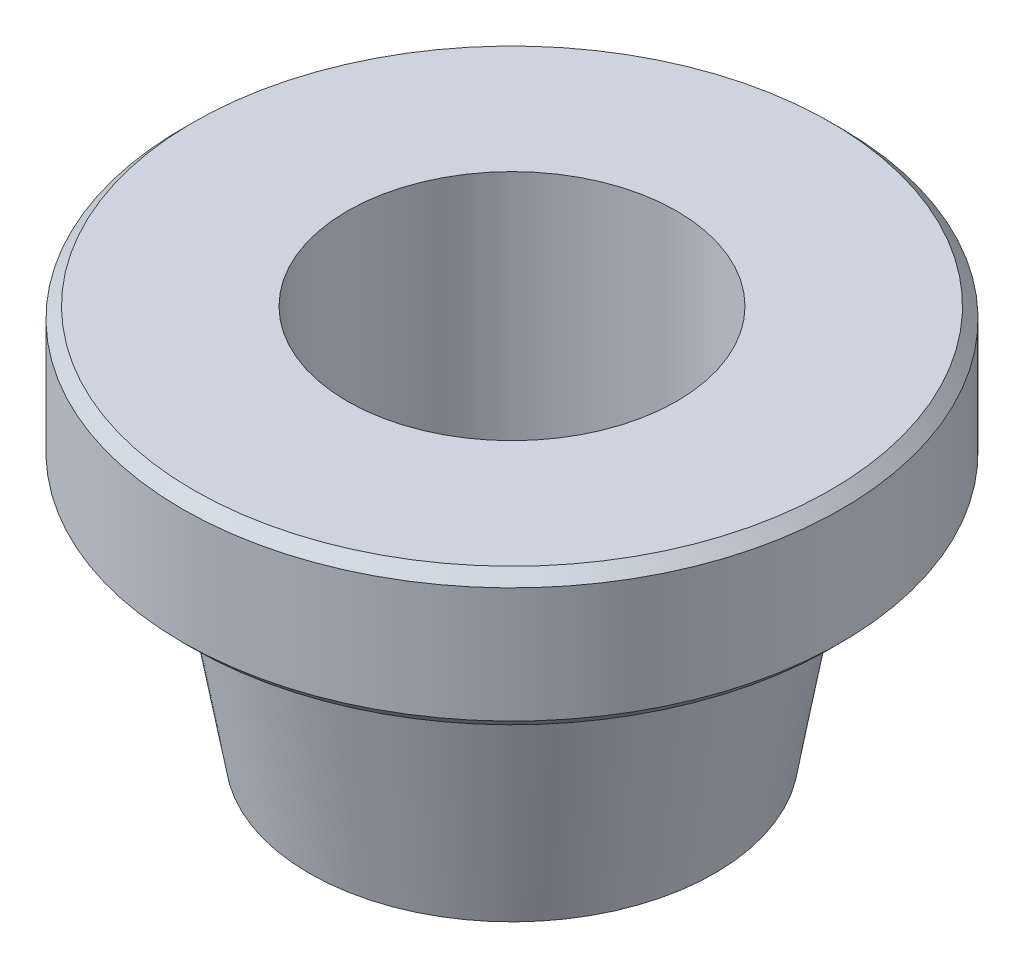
from build123d import *

# Parameters (mm, degrees)
SKICA1_R                 = 4.5
P_IDAT_VYSUNUT_M1_DEPTH  = 4.6
P_IDAT_VYSUNUT_M1_DRAFT  = -10
SKICA2_R                 = 6
P_IDAT_VYSUNUT_M2_DEPTH  = 2.5
ZKOSEN_1_SIZE            = 0.2
SKICA3_R                 = 3
ODEBRAT_VYSUNUT_M1_DEPTH = 2.5
ODEBRAT_START            = -4.6
SKICA4_R                 = 3
ODEBRAT_VYSUNUT_M2_DEPTH = 4.6
SKICA5_W                 = 0.3
SKICA5_H                 = 0.5


with BuildPart() as part:
    # Skica1 → P_idat vysunut_m1 (with draft: the straight prism first)
    with BuildSketch(Plane(origin=(0, 0, 0), x_dir=(1, 0, 0), z_dir=(0, 1, 0))):
        Circle(SKICA1_R)
    extrude(amount=-P_IDAT_VYSUNUT_M1_DEPTH)
    # P_idat vysunut_m1: the draft: its side faces are tilted about the plane it starts from
    p_idat_vysunut_m1_sides = [part.faces().sort_by_distance(p)[0] for p in [
        (-4.5, -2.3, 0),
    ]]
    draft(p_idat_vysunut_m1_sides, Plane(origin=(0, 0, 0), x_dir=(1, 0, 0), z_dir=(0, 1, 0)), P_IDAT_VYSUNUT_M1_DRAFT)

    # Skica2 → P_idat vysunut_m2 (add)
    with BuildSketch(Plane(origin=(0, 0, 0), x_dir=(-1, 0, 0), z_dir=(0, 1, 0))):
        with Locations(Location((0, 0, 0), (0, 0, 90))):
            Circle(SKICA2_R)
    extrude(amount=P_IDAT_VYSUNUT_M2_DEPTH)

    # Zkosen_1
    zkosen_1_edges = [part.edges().sort_by_distance(p)[0] for p in [
        (0, 0, -6),
        (0, 2.5, -6),
    ]]
    chamfer(zkosen_1_edges, length=ZKOSEN_1_SIZE)

    # Skica3 → Odebrat vysunut_m1 (cut)
    with BuildSketch(Plane(origin=(0, 2.5, 0), x_dir=(1, 0, 0), z_dir=(0, 1, 0))):
        with Locations(Location((0, 0, 0), (0, 0, 270))):
            Circle(SKICA3_R)
    extrude(amount=-ODEBRAT_VYSUNUT_M1_DEPTH, mode=Mode.SUBTRACT)

    # Skica4 → Odebrat vysunut_m2 (cut)
    with BuildSketch(Plane.XZ.offset(4.6).offset(ODEBRAT_START)):
        with Locations(Location((0, 0, 0), (0, 0, 90))):
            Circle(SKICA4_R)
    extrude(amount=ODEBRAT_VYSUNUT_M2_DEPTH, mode=Mode.SUBTRACT)

    # Skica5 → Odebrat rotac_1 (revolve, cut)
    with BuildSketch(Plane.XY, mode=Mode.PRIVATE) as odebrat_rotac_1_sk:
        with Locations((-3.15, -3.35)):
            Rectangle(SKICA5_W, SKICA5_H)
    revolve(odebrat_rotac_1_sk.sketch.rotate(Axis((0, 2.5, 0), (0, -1, 0)), 270), axis=Axis((0, 2.5, 0), (0, -1, 0)), mode=Mode.SUBTRACT)


solid = part.part
